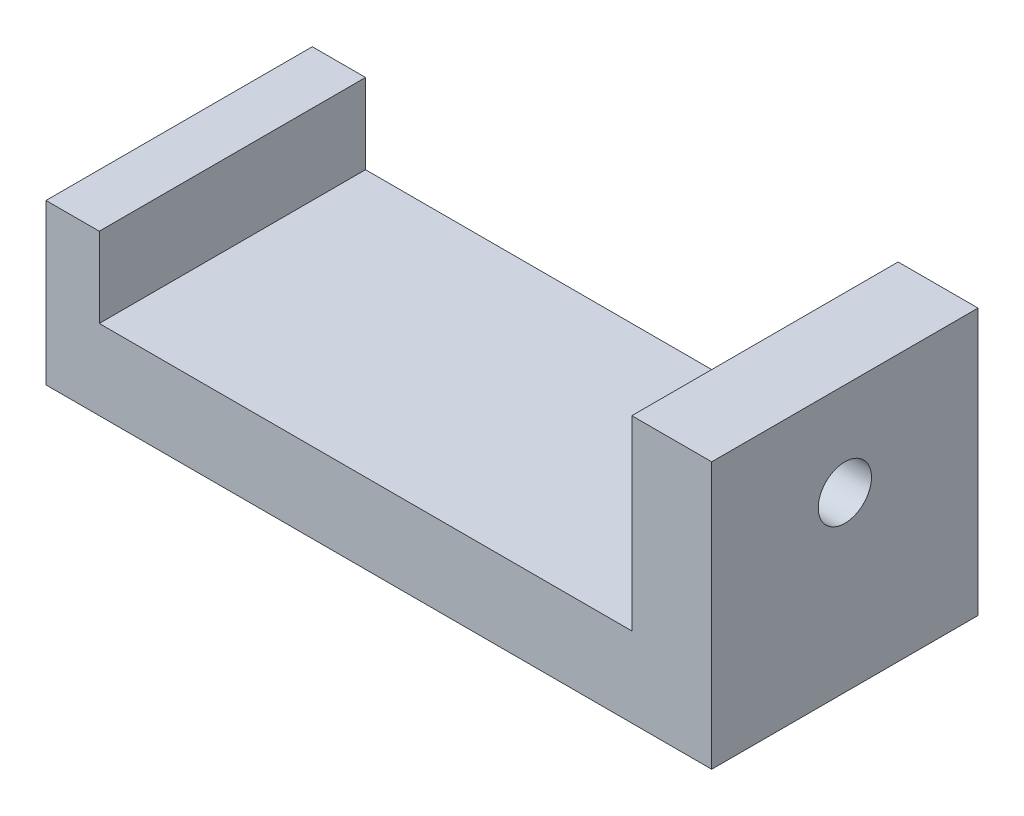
from build123d import *

# Parameters (mm, degrees)
LINEAR_AUSTRAGEN1_DEPTH              = 50
F_10_0_10_DURCHMESSER_BOHRUNG1_D     = 10
F_10_0_10_DURCHMESSER_BOHRUNG1_DEPTH = 25
F_10_0_10_DURCHMESSER_BOHRUNG1_TIP   = 3.004303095


with BuildPart() as part:
    # Skizze1 → Linear austragen1 (new body)
    with BuildSketch(Plane.XY):
        Polygon((0, 30), (0, 0), (125, 0), (125, 50), (110, 50), (110, 15), (10, 15), (10, 30), align=None)
    extrude(amount=LINEAR_AUSTRAGEN1_DEPTH)

    # 10.0 _10_ Durchmesser Bohrung1
    with Locations(Plane(origin=(125, 0, 0), x_dir=(0, 0, -1), z_dir=(1, 0, 0))):
        with Locations((-25, 32.5)):
            Hole(F_10_0_10_DURCHMESSER_BOHRUNG1_D / 2, depth=F_10_0_10_DURCHMESSER_BOHRUNG1_DEPTH)
            with Locations((0, 0, -(F_10_0_10_DURCHMESSER_BOHRUNG1_DEPTH + F_10_0_10_DURCHMESSER_BOHRUNG1_TIP / 2))):  # 118° drill point
                Cone(0, F_10_0_10_DURCHMESSER_BOHRUNG1_D / 2, F_10_0_10_DURCHMESSER_BOHRUNG1_TIP, mode=Mode.SUBTRACT)


solid = part.part
